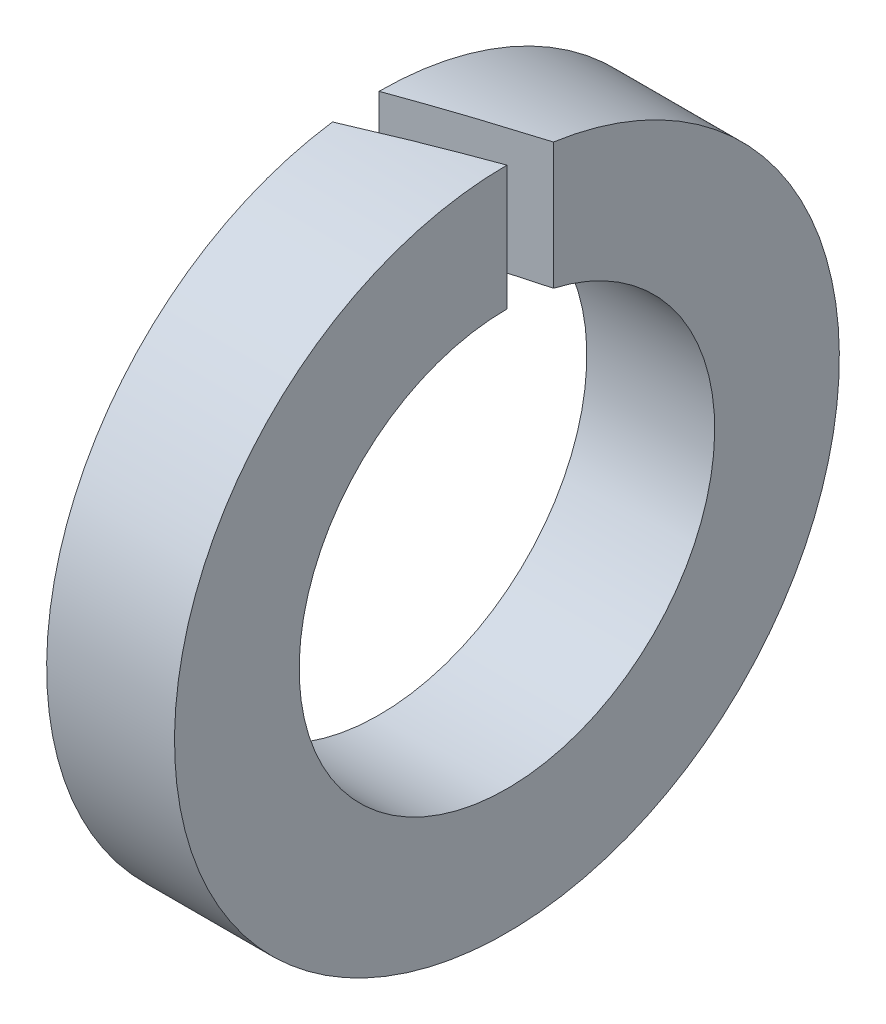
from build123d import *

# Parameters (mm, degrees)
ESQUISSE1_W             = 2
ESQUISSE1_H             = 1.95
ENL_V_MAT_EXTRU_1_DEPTH = 8.621023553


with BuildPart() as part:
    # Esquisse1 → Base-R_volution (revolve)
    with BuildSketch(Plane(origin=(0, 0, 0), x_dir=(1, 0, 0), z_dir=(0, 1, 0))):
        with Locations((1, 4.225)):
            Rectangle(ESQUISSE1_W, ESQUISSE1_H)
    revolve(axis=Axis((0, 0, 0), (1, 0, 0)))

    # Esquisse2 → Enl_v. mat.-Extru.1 (cut, through all)
    with BuildSketch(Plane(origin=(0, 0, 0), x_dir=(1, 0, 0), z_dir=(0, 1, 0))):
        Polygon((0, 0), (2, 0.727940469), (2, 0), (0, -0.727940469), align=None)
    extrude(amount=ENL_V_MAT_EXTRU_1_DEPTH, mode=Mode.SUBTRACT)


solid = part.part
